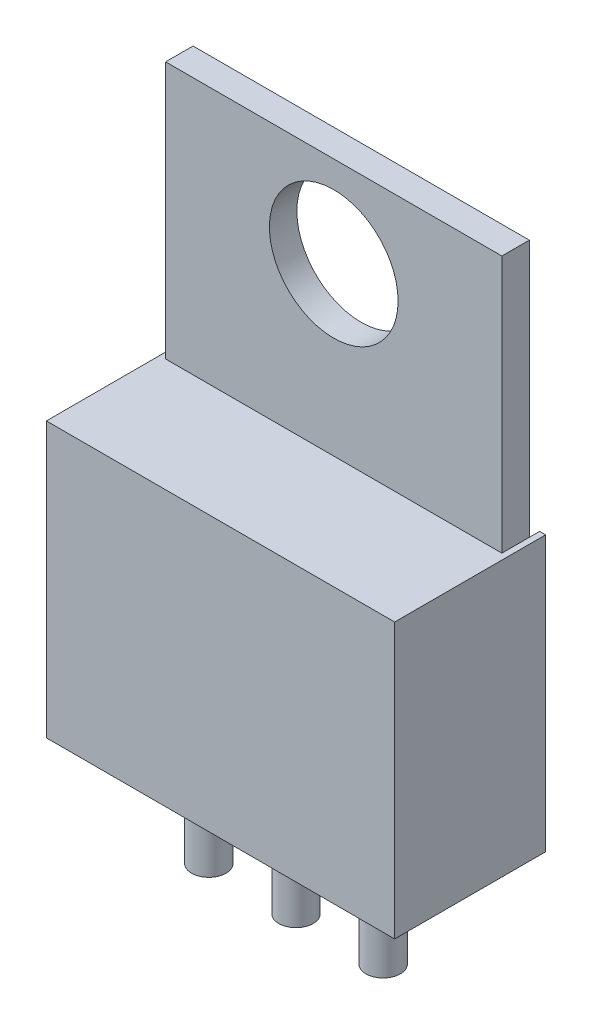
from build123d import *

# Parameters (mm, degrees)
ESQUISSE1_W             = 10.15
ESQUISSE1_H             = 15.5
EXTRUSION1_DEPTH        = 1.1
ESQUISSE2_R             = 1.875
ENL_V_MAT_EXTRU_1_DEPTH = 19.560239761
ESQUISSE3_W             = 10.15
ESQUISSE3_H             = 8
EXTRUSION2_DEPTH        = 3.3
ESQUISSE5_R             = 0.5
EXTRUSION3_DEPTH        = 3
ESQUISSE6_W             = 0.175
ESQUISSE6_H             = 7.5
ENL_V_MAT_EXTRU_2_DEPTH = 1.2
ESQUISSE7_W             = 9.8
ESQUISSE7_H             = 13.5
ESQUISSE7_W_2           = 3.75
ESQUISSE7_H_2           = 1
ENL_V_MAT_EXTRU_4_DEPTH = 0.3


with BuildPart() as part:
    # Esquisse1 → Extrusion1 (new body)
    with BuildSketch(Plane.XY):
        with Locations((5.075, 7.75)):
            Rectangle(ESQUISSE1_W, ESQUISSE1_H)
    extrude(amount=EXTRUSION1_DEPTH)

    # Esquisse2 → Enl_v. mat.-Extru.1 (cut, through all)
    with BuildSketch(Plane.XY.offset(1.1)):
        with Locations((5.075, 12.85)):
            Circle(ESQUISSE2_R)
    extrude(amount=-ENL_V_MAT_EXTRU_1_DEPTH, mode=Mode.SUBTRACT)

    # Esquisse3 → Extrusion2 (add)
    with BuildSketch(Plane.XY.offset(1.1)):
        with Locations((5.075, 4)):
            Rectangle(ESQUISSE3_W, ESQUISSE3_H)
    extrude(amount=EXTRUSION2_DEPTH)

    # Esquisse5 → Extrusion3 (add)
    with BuildSketch(Plane.XZ):
        with Locations(Location((5.075, 2.2, 0), (0, 0, 90))):
            Circle(ESQUISSE5_R)
        with Locations(Location((7.615, 2.2, 0), (0, 0, 90))):
            Circle(ESQUISSE5_R)
        with Locations(Location((2.535, 2.2, 0), (0, 0, 90))):
            Circle(ESQUISSE5_R)
    extrude(amount=EXTRUSION3_DEPTH)

    # Esquisse6 → Enl_v. mat.-Extru.2 (cut)
    with BuildSketch(Plane.XY.offset(1.1)):
        with Locations((0.0875, 11.75)):
            Rectangle(ESQUISSE6_W, ESQUISSE6_H)
        with Locations((10.0625, 11.75)):
            Rectangle(ESQUISSE6_W, ESQUISSE6_H)
    extrude(amount=-ENL_V_MAT_EXTRU_2_DEPTH, mode=Mode.SUBTRACT)

    # Esquisse7 → Enl_v. mat.-Extru.4 (cut)
    with BuildSketch(Plane(origin=(0, 0, 0), x_dir=(-1, 0, 0), z_dir=(0, 0, -1))):
        with Locations((-5.075, 8.75)):
            Rectangle(ESQUISSE7_W, ESQUISSE7_H)
        with Locations((-5.075, 7.5)):
            Rectangle(ESQUISSE7_W_2, ESQUISSE7_H_2, mode=Mode.SUBTRACT)
    extrude(amount=-ENL_V_MAT_EXTRU_4_DEPTH, mode=Mode.SUBTRACT)


solid = part.part
